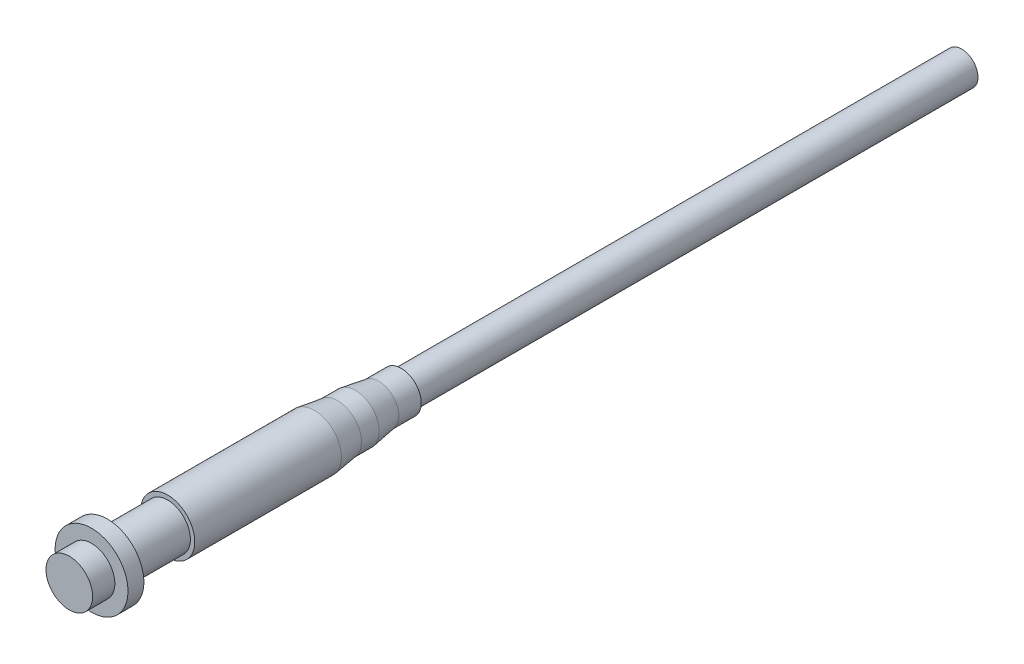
from build123d import *

# Parameters (mm, degrees)
SKETCH3_R      = 8.89
EXTRUDE1_DEPTH = 304.8


with BuildPart() as part:
    # Sketch1 → Revolve1 (revolve)
    with BuildSketch(Plane(origin=(0, 0, 0), x_dir=(1, 0, 0), z_dir=(0, 1, 0))):
        Polygon((0, -12.0904), (-12.6746, -12.0904), (-12.6746, 0), (-19.812, 0), (-19.812, 8.636), (-12.3825, 8.636), (-12.3825, 41.402), (-14.732, 41.402), (-14.732, 121.158), (-12.954, 133.858), (-12.954, 143.51), (-10.922, 156.21), (-10.922, 168.402), (0, 168.402), align=None)
    revolve(axis=Axis((0, 0, -204.828193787), (0, 0, 1)))

    # Sketch3 → Extrude1 (add)
    with BuildSketch(Plane(origin=(0, 0, -168.402), x_dir=(-1, 0, 0), z_dir=(0, 0, -1))):
        with Locations(Location((0, 0, 0), (0, 0, 180))):
            Circle(SKETCH3_R)
    extrude(amount=EXTRUDE1_DEPTH)


solid = part.part
